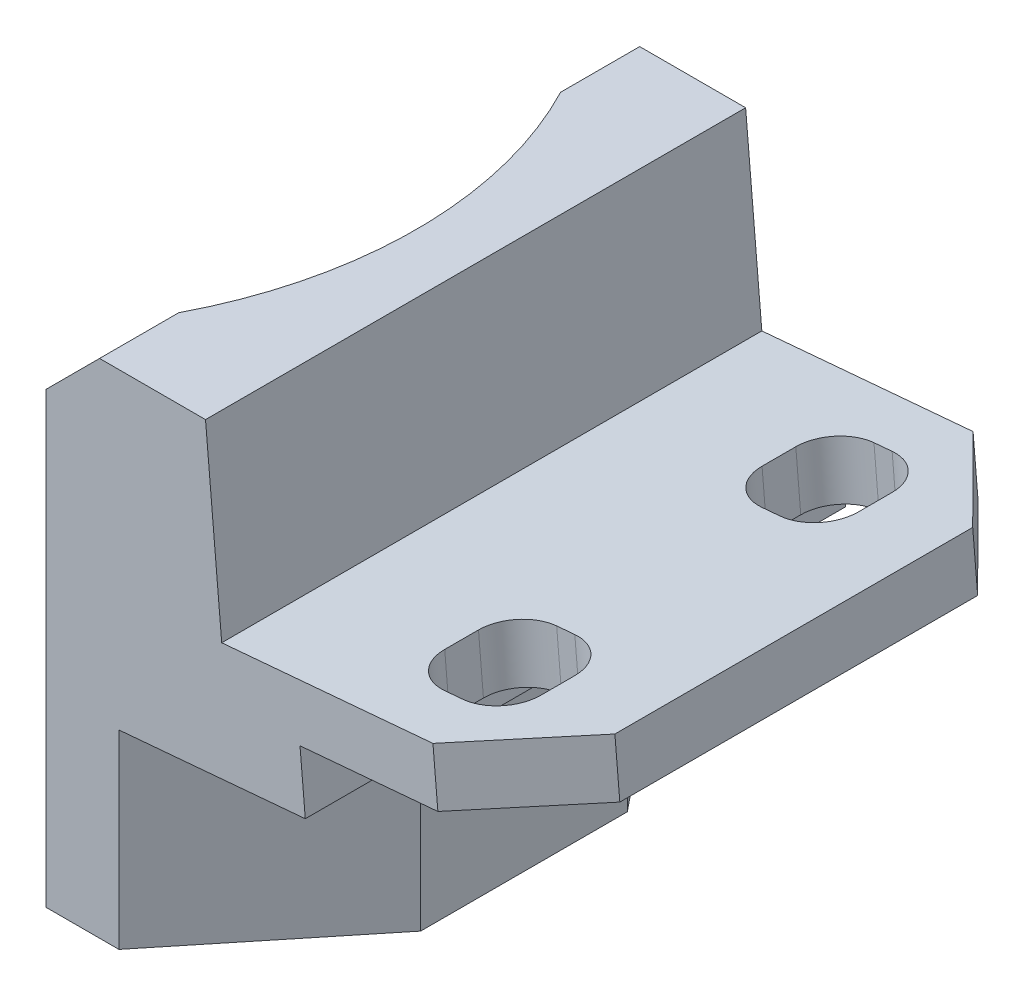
ISO-10303-21;
HEADER;
FILE_DESCRIPTION(('STEP AP214'),'2;1');
FILE_NAME('part.step','',(''),(''),'','','');
FILE_SCHEMA(('AUTOMOTIVE_DESIGN { 1 0 10303 214 1 1 1 1 }'));
ENDSEC;
DATA;
#1=APPLICATION_CONTEXT('core data for automotive mechanical design processes');
#2=APPLICATION_PROTOCOL_DEFINITION('international standard','automotive_design',2000,#1);
#3=PRODUCT_CONTEXT('',#1,'mechanical');
#4=PRODUCT('Part','Part','',(#3));
#5=PRODUCT_RELATED_PRODUCT_CATEGORY('part','',(#4));
#6=PRODUCT_DEFINITION_FORMATION('','',#4);
#7=PRODUCT_DEFINITION_CONTEXT('part definition',#1,'design');
#8=PRODUCT_DEFINITION('design','',#6,#7);
#9=PRODUCT_DEFINITION_SHAPE('','',#8);
#10=(LENGTH_UNIT() NAMED_UNIT(*) SI_UNIT(.MILLI.,.METRE.));
#11=(NAMED_UNIT(*) PLANE_ANGLE_UNIT() SI_UNIT($,.RADIAN.));
#12=(NAMED_UNIT(*) SI_UNIT($,.STERADIAN.) SOLID_ANGLE_UNIT());
#13=UNCERTAINTY_MEASURE_WITH_UNIT(LENGTH_MEASURE(1.E-05),#10,'distance_accuracy_value','');
#14=(GEOMETRIC_REPRESENTATION_CONTEXT(3) GLOBAL_UNCERTAINTY_ASSIGNED_CONTEXT((#13)) GLOBAL_UNIT_ASSIGNED_CONTEXT((#10,
#11,#12)) REPRESENTATION_CONTEXT('',''));
#15=CARTESIAN_POINT('',(0.,0.,0.));
#16=DIRECTION('',(0.,0.,1.));
#17=DIRECTION('',(1.,0.,0.));
#18=AXIS2_PLACEMENT_3D('',#15,#16,#17);
#19=CARTESIAN_POINT('',(30.279335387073,-5.97249765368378,10.16));
#20=DIRECTION('',(-0.996194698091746,-0.0871557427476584,0.));
#21=DIRECTION('',(0.0871557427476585,-0.996194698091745,0.));
#22=AXIS2_PLACEMENT_3D('',#19,#20,#21);
#23=PLANE('',#22);
#24=DIRECTION('',(0.,0.,1.));
#25=VECTOR('',#24,1.);
#26=CARTESIAN_POINT('',(30.4652908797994,-8.09797866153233,10.16));
#27=LINE('',#26,#25);
#28=CARTESIAN_POINT('',(30.4652908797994,-8.09797866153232,-6.73099999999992));
#29=VERTEX_POINT('',#28);
#30=CARTESIAN_POINT('',(30.4652908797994,-8.09797866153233,6.73099999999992));
#31=VERTEX_POINT('',#30);
#32=EDGE_CURVE('E468',#29,#31,#27,.T.);
#33=ORIENTED_EDGE('',*,*,#32,.F.);
#34=DIRECTION('',(-0.0871557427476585,0.996194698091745,0.));
#35=VECTOR('',#34,1.);
#36=CARTESIAN_POINT('',(30.2793353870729,-5.97249765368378,-6.731));
#37=LINE('',#36,#35);
#38=CARTESIAN_POINT('',(30.2793353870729,-5.97249765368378,-6.73099999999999));
#39=VERTEX_POINT('',#38);
#40=EDGE_CURVE('E312',#29,#39,#37,.T.);
#41=ORIENTED_EDGE('',*,*,#40,.T.);
#42=DIRECTION('',(0.,0.,-1.));
#43=VECTOR('',#42,1.);
#44=CARTESIAN_POINT('',(30.279335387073,-5.97249765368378,10.16));
#45=LINE('',#44,#43);
#46=CARTESIAN_POINT('',(30.279335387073,-5.97249765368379,6.73099999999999));
#47=VERTEX_POINT('',#46);
#48=EDGE_CURVE('E283',#47,#39,#45,.T.);
#49=ORIENTED_EDGE('',*,*,#48,.F.);
#50=DIRECTION('',(0.0871557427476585,-0.996194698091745,0.));
#51=VECTOR('',#50,1.);
#52=CARTESIAN_POINT('',(30.6645289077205,-10.3752797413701,6.73099999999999));
#53=LINE('',#52,#51);
#54=EDGE_CURVE('E314',#47,#31,#53,.T.);
#55=ORIENTED_EDGE('',*,*,#54,.T.);
#56=EDGE_LOOP('',(#33,#41,#49,#55));
#57=FACE_BOUND('',#56,.T.);
#58=ADVANCED_FACE('F32',(#57),#23,.F.);
#59=CARTESIAN_POINT('',(26.2677276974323,0.537025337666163,10.16));
#60=DIRECTION('',(0.70441602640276,0.0616284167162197,0.707106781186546));
#61=DIRECTION('',(0.708453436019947,0.,-0.705757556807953));
#62=AXIS2_PLACEMENT_3D('',#59,#60,#61);
#63=PLANE('',#62);
#64=DIRECTION('',(-0.0871557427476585,0.996194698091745,0.));
#65=VECTOR('',#64,1.);
#66=CARTESIAN_POINT('',(26.8633837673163,-6.2713546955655,10.16));
#67=LINE('',#66,#65);
#68=CARTESIAN_POINT('',(27.0493392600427,-8.39683570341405,10.16));
#69=VERTEX_POINT('',#68);
#70=CARTESIAN_POINT('',(26.8633837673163,-6.2713546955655,10.16));
#71=VERTEX_POINT('',#70);
#72=EDGE_CURVE('E306',#69,#71,#67,.T.);
#73=ORIENTED_EDGE('',*,*,#72,.F.);
#74=DIRECTION('',(0.704416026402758,0.0616284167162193,-0.707106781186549));
#75=VECTOR('',#74,1.);
#76=CARTESIAN_POINT('',(27.0493392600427,-8.39683570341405,10.16));
#77=LINE('',#76,#75);
#78=EDGE_CURVE('E407',#69,#31,#77,.T.);
#79=ORIENTED_EDGE('',*,*,#78,.T.);
#80=ORIENTED_EDGE('',*,*,#54,.F.);
#81=DIRECTION('',(0.704416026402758,0.0616284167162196,-0.707106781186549));
#82=VECTOR('',#81,1.);
#83=CARTESIAN_POINT('',(26.8633837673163,-6.2713546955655,10.16));
#84=LINE('',#83,#82);
#85=EDGE_CURVE('E310',#71,#47,#84,.T.);
#86=ORIENTED_EDGE('',*,*,#85,.F.);
#87=EDGE_LOOP('',(#73,#79,#80,#86));
#88=FACE_BOUND('',#87,.T.);
#89=ADVANCED_FACE('F516',(#88),#63,.T.);
#90=CARTESIAN_POINT('',(30.2793353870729,-5.97249765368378,-6.731));
#91=DIRECTION('',(-0.704416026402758,-0.0616284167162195,0.707106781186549));
#92=DIRECTION('',(0.70845343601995,0.,0.705757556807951));
#93=AXIS2_PLACEMENT_3D('',#90,#91,#92);
#94=PLANE('',#93);
#95=ORIENTED_EDGE('',*,*,#40,.F.);
#96=DIRECTION('',(0.70441602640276,0.0616284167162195,0.707106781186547));
#97=VECTOR('',#96,1.);
#98=CARTESIAN_POINT('',(30.4652908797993,-8.09797866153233,-6.731));
#99=LINE('',#98,#97);
#100=CARTESIAN_POINT('',(27.0493392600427,-8.39683570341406,-10.16));
#101=VERTEX_POINT('',#100);
#102=EDGE_CURVE('E510',#29,#101,#99,.F.);
#103=ORIENTED_EDGE('',*,*,#102,.T.);
#104=DIRECTION('',(0.0871557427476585,-0.996194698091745,0.));
#105=VECTOR('',#104,1.);
#106=CARTESIAN_POINT('',(26.2677276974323,0.537025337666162,-10.16));
#107=LINE('',#106,#105);
#108=CARTESIAN_POINT('',(26.8633837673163,-6.2713546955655,-10.16));
#109=VERTEX_POINT('',#108);
#110=EDGE_CURVE('E317',#109,#101,#107,.T.);
#111=ORIENTED_EDGE('',*,*,#110,.F.);
#112=DIRECTION('',(0.70441602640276,0.0616284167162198,0.707106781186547));
#113=VECTOR('',#112,1.);
#114=CARTESIAN_POINT('',(30.2793353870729,-5.97249765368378,-6.731));
#115=LINE('',#114,#113);
#116=EDGE_CURVE('E308',#39,#109,#115,.F.);
#117=ORIENTED_EDGE('',*,*,#116,.F.);
#118=EDGE_LOOP('',(#95,#103,#111,#117));
#119=FACE_BOUND('',#118,.T.);
#120=ADVANCED_FACE('F34',(#119),#94,.F.);
#121=CARTESIAN_POINT('',(25.2427902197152,1.17768629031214,6.604));
#122=DIRECTION('',(0.0871557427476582,-0.996194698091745,0.));
#123=DIRECTION('',(0.996194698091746,0.0871557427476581,0.));
#124=AXIS2_PLACEMENT_3D('',#121,#122,#123);
#125=CYLINDRICAL_SURFACE('',#124,1.4732);
#126=CARTESIAN_POINT('',(26.0878121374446,-8.4809584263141,6.604));
#127=DIRECTION('',(0.0871557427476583,-0.996194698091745,0.));
#128=DIRECTION('',(0.996194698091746,0.0871557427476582,0.));
#129=AXIS2_PLACEMENT_3D('',#126,#127,#128);
#130=CIRCLE('',#129,1.4732);
#131=CARTESIAN_POINT('',(26.0878121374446,-8.4809584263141,8.0772));
#132=VERTEX_POINT('',#131);
#133=CARTESIAN_POINT('',(27.5554061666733,-8.35256058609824,6.60399999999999));
#134=VERTEX_POINT('',#133);
#135=EDGE_CURVE('E506',#132,#134,#130,.F.);
#136=ORIENTED_EDGE('',*,*,#135,.F.);
#137=DIRECTION('',(0.0871557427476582,-0.996194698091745,0.));
#138=VECTOR('',#137,1.);
#139=CARTESIAN_POINT('',(25.2427902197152,1.17768629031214,8.0772));
#140=LINE('',#139,#138);
#141=CARTESIAN_POINT('',(25.9018566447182,-6.35547741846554,8.0772));
#142=VERTEX_POINT('',#141);
#143=EDGE_CURVE('E409',#142,#132,#140,.T.);
#144=ORIENTED_EDGE('',*,*,#143,.F.);
#145=CARTESIAN_POINT('',(25.9018566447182,-6.35547741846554,6.604));
#146=DIRECTION('',(0.0871557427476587,-0.996194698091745,0.));
#147=DIRECTION('',(0.996194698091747,0.0871557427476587,0.));
#148=AXIS2_PLACEMENT_3D('',#145,#146,#147);
#149=CIRCLE('',#148,1.4732);
#150=CARTESIAN_POINT('',(27.3694506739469,-6.22707957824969,6.60399999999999));
#151=VERTEX_POINT('',#150);
#152=EDGE_CURVE('E329',#151,#142,#149,.T.);
#153=ORIENTED_EDGE('',*,*,#152,.F.);
#154=DIRECTION('',(0.0871557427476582,-0.996194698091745,0.));
#155=VECTOR('',#154,1.);
#156=CARTESIAN_POINT('',(26.710384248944,1.30608413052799,6.60399999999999));
#157=LINE('',#156,#155);
#158=EDGE_CURVE('E410',#151,#134,#157,.T.);
#159=ORIENTED_EDGE('',*,*,#158,.T.);
#160=EDGE_LOOP('',(#136,#144,#153,#159));
#161=FACE_BOUND('',#160,.T.);
#162=ADVANCED_FACE('F566',(#161),#125,.F.);
#163=CARTESIAN_POINT('',(26.710384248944,1.30608413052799,6.60399999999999));
#164=DIRECTION('',(0.996194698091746,0.0871557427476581,0.));
#165=DIRECTION('',(-0.0871557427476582,0.996194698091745,0.));
#166=AXIS2_PLACEMENT_3D('',#163,#164,#165);
#167=PLANE('',#166);
#168=DIRECTION('',(0.,0.,-1.));
#169=VECTOR('',#168,1.);
#170=CARTESIAN_POINT('',(27.5554061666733,-8.35256058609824,6.60399999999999));
#171=LINE('',#170,#169);
#172=CARTESIAN_POINT('',(27.5554061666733,-8.35256058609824,5.33400000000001));
#173=VERTEX_POINT('',#172);
#174=EDGE_CURVE('E504',#134,#173,#171,.T.);
#175=ORIENTED_EDGE('',*,*,#174,.F.);
#176=ORIENTED_EDGE('',*,*,#158,.F.);
#177=DIRECTION('',(0.,0.,1.));
#178=VECTOR('',#177,1.);
#179=CARTESIAN_POINT('',(27.3694506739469,-6.22707957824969,10.16));
#180=LINE('',#179,#178);
#181=CARTESIAN_POINT('',(27.3694506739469,-6.2270795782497,5.33400000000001));
#182=VERTEX_POINT('',#181);
#183=EDGE_CURVE('E341',#182,#151,#180,.T.);
#184=ORIENTED_EDGE('',*,*,#183,.F.);
#185=DIRECTION('',(0.0871557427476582,-0.996194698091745,0.));
#186=VECTOR('',#185,1.);
#187=CARTESIAN_POINT('',(26.710384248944,1.30608413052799,5.33400000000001));
#188=LINE('',#187,#186);
#189=EDGE_CURVE('E414',#182,#173,#188,.T.);
#190=ORIENTED_EDGE('',*,*,#189,.T.);
#191=EDGE_LOOP('',(#175,#176,#184,#190));
#192=FACE_BOUND('',#191,.T.);
#193=ADVANCED_FACE('F571',(#192),#167,.F.);
#194=CARTESIAN_POINT('',(25.2427902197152,1.17768629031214,5.334));
#195=DIRECTION('',(0.0871557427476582,-0.996194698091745,0.));
#196=DIRECTION('',(0.996194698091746,0.0871557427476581,0.));
#197=AXIS2_PLACEMENT_3D('',#194,#195,#196);
#198=CYLINDRICAL_SURFACE('',#197,1.4732);
#199=CARTESIAN_POINT('',(26.0878121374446,-8.4809584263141,5.334));
#200=DIRECTION('',(0.0871557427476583,-0.996194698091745,0.));
#201=DIRECTION('',(0.996194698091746,0.0871557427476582,0.));
#202=AXIS2_PLACEMENT_3D('',#199,#200,#201);
#203=CIRCLE('',#202,1.4732);
#204=CARTESIAN_POINT('',(26.0878121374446,-8.4809584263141,3.8608));
#205=VERTEX_POINT('',#204);
#206=EDGE_CURVE('E502',#173,#205,#203,.F.);
#207=ORIENTED_EDGE('',*,*,#206,.F.);
#208=ORIENTED_EDGE('',*,*,#189,.F.);
#209=CARTESIAN_POINT('',(25.9018566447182,-6.35547741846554,5.334));
#210=DIRECTION('',(0.0871557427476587,-0.996194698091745,0.));
#211=DIRECTION('',(0.996194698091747,0.0871557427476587,0.));
#212=AXIS2_PLACEMENT_3D('',#209,#210,#211);
#213=CIRCLE('',#212,1.4732);
#214=CARTESIAN_POINT('',(25.9018566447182,-6.35547741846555,3.8608));
#215=VERTEX_POINT('',#214);
#216=EDGE_CURVE('E338',#215,#182,#213,.T.);
#217=ORIENTED_EDGE('',*,*,#216,.F.);
#218=DIRECTION('',(0.0871557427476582,-0.996194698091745,0.));
#219=VECTOR('',#218,1.);
#220=CARTESIAN_POINT('',(25.2427902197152,1.17768629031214,3.8608));
#221=LINE('',#220,#219);
#222=EDGE_CURVE('E417',#215,#205,#221,.T.);
#223=ORIENTED_EDGE('',*,*,#222,.T.);
#224=EDGE_LOOP('',(#207,#208,#217,#223));
#225=FACE_BOUND('',#224,.T.);
#226=ADVANCED_FACE('F672',(#225),#198,.F.);
#227=CARTESIAN_POINT('',(25.2427902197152,1.17768629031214,3.86080000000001));
#228=DIRECTION('',(0.,0.,-1.));
#229=DIRECTION('',(-1.,0.,0.));
#230=AXIS2_PLACEMENT_3D('',#227,#228,#229);
#231=PLANE('',#230);
#232=DIRECTION('',(-0.996194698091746,-0.0871557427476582,0.));
#233=VECTOR('',#232,1.);
#234=CARTESIAN_POINT('',(26.0878121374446,-8.4809584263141,3.8608));
#235=LINE('',#234,#233);
#236=CARTESIAN_POINT('',(25.4046218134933,-8.54072983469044,3.8608));
#237=VERTEX_POINT('',#236);
#238=EDGE_CURVE('E500',#205,#237,#235,.T.);
#239=ORIENTED_EDGE('',*,*,#238,.F.);
#240=ORIENTED_EDGE('',*,*,#222,.F.);
#241=DIRECTION('',(0.996194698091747,0.0871557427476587,0.));
#242=VECTOR('',#241,1.);
#243=CARTESIAN_POINT('',(20.1579972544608,-6.858,3.8608));
#244=LINE('',#243,#242);
#245=CARTESIAN_POINT('',(25.2186663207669,-6.41524882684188,3.8608));
#246=VERTEX_POINT('',#245);
#247=EDGE_CURVE('E335',#246,#215,#244,.T.);
#248=ORIENTED_EDGE('',*,*,#247,.F.);
#249=DIRECTION('',(0.0871557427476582,-0.996194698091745,0.));
#250=VECTOR('',#249,1.);
#251=CARTESIAN_POINT('',(24.5595998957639,1.1179148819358,3.8608));
#252=LINE('',#251,#250);
#253=EDGE_CURVE('E420',#246,#237,#252,.T.);
#254=ORIENTED_EDGE('',*,*,#253,.T.);
#255=EDGE_LOOP('',(#239,#240,#248,#254));
#256=FACE_BOUND('',#255,.T.);
#257=ADVANCED_FACE('F681',(#256),#231,.F.);
#258=CARTESIAN_POINT('',(24.5595998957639,1.1179148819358,5.334));
#259=DIRECTION('',(0.0871557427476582,-0.996194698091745,0.));
#260=DIRECTION('',(0.996194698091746,0.0871557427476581,0.));
#261=AXIS2_PLACEMENT_3D('',#258,#259,#260);
#262=CYLINDRICAL_SURFACE('',#261,1.4732);
#263=CARTESIAN_POINT('',(25.4046218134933,-8.54072983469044,5.334));
#264=DIRECTION('',(0.0871557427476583,-0.996194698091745,0.));
#265=DIRECTION('',(0.996194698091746,0.0871557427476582,0.));
#266=AXIS2_PLACEMENT_3D('',#263,#264,#265);
#267=CIRCLE('',#266,1.4732);
#268=CARTESIAN_POINT('',(23.9370277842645,-8.66912767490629,5.334));
#269=VERTEX_POINT('',#268);
#270=EDGE_CURVE('E498',#237,#269,#267,.F.);
#271=ORIENTED_EDGE('',*,*,#270,.F.);
#272=ORIENTED_EDGE('',*,*,#253,.F.);
#273=CARTESIAN_POINT('',(25.2186663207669,-6.41524882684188,5.334));
#274=DIRECTION('',(0.0871557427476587,-0.996194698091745,0.));
#275=DIRECTION('',(0.996194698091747,0.0871557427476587,0.));
#276=AXIS2_PLACEMENT_3D('',#273,#274,#275);
#277=CIRCLE('',#276,1.4732);
#278=CARTESIAN_POINT('',(23.7510722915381,-6.54364666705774,5.334));
#279=VERTEX_POINT('',#278);
#280=EDGE_CURVE('E332',#279,#246,#277,.T.);
#281=ORIENTED_EDGE('',*,*,#280,.F.);
#282=DIRECTION('',(0.0871557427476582,-0.996194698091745,0.));
#283=VECTOR('',#282,1.);
#284=CARTESIAN_POINT('',(23.0920058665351,0.989517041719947,5.334));
#285=LINE('',#284,#283);
#286=EDGE_CURVE('E423',#279,#269,#285,.T.);
#287=ORIENTED_EDGE('',*,*,#286,.T.);
#288=EDGE_LOOP('',(#271,#272,#281,#287));
#289=FACE_BOUND('',#288,.T.);
#290=ADVANCED_FACE('F690',(#289),#262,.F.);
#291=CARTESIAN_POINT('',(24.5595998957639,1.1179148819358,6.604));
#292=DIRECTION('',(0.0871557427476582,-0.996194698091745,0.));
#293=DIRECTION('',(0.996194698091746,0.0871557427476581,0.));
#294=AXIS2_PLACEMENT_3D('',#291,#292,#293);
#295=CYLINDRICAL_SURFACE('',#294,1.4732);
#296=CARTESIAN_POINT('',(25.4046218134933,-8.54072983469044,6.604));
#297=DIRECTION('',(0.0871557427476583,-0.996194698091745,0.));
#298=DIRECTION('',(0.996194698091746,0.0871557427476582,0.));
#299=AXIS2_PLACEMENT_3D('',#296,#297,#298);
#300=CIRCLE('',#299,1.4732);
#301=CARTESIAN_POINT('',(23.9370277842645,-8.66912767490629,6.604));
#302=VERTEX_POINT('',#301);
#303=CARTESIAN_POINT('',(25.4046218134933,-8.54072983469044,8.0772));
#304=VERTEX_POINT('',#303);
#305=EDGE_CURVE('E496',#302,#304,#300,.F.);
#306=ORIENTED_EDGE('',*,*,#305,.F.);
#307=DIRECTION('',(0.0871557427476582,-0.996194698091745,0.));
#308=VECTOR('',#307,1.);
#309=CARTESIAN_POINT('',(23.0920058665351,0.989517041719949,6.604));
#310=LINE('',#309,#308);
#311=CARTESIAN_POINT('',(23.7510722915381,-6.54364666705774,6.604));
#312=VERTEX_POINT('',#311);
#313=EDGE_CURVE('E426',#312,#302,#310,.T.);
#314=ORIENTED_EDGE('',*,*,#313,.F.);
#315=CARTESIAN_POINT('',(25.2186663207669,-6.41524882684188,6.604));
#316=DIRECTION('',(0.0871557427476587,-0.996194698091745,0.));
#317=DIRECTION('',(0.996194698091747,0.0871557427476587,0.));
#318=AXIS2_PLACEMENT_3D('',#315,#316,#317);
#319=CIRCLE('',#318,1.4732);
#320=CARTESIAN_POINT('',(25.2186663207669,-6.41524882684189,8.0772));
#321=VERTEX_POINT('',#320);
#322=EDGE_CURVE('E326',#321,#312,#319,.T.);
#323=ORIENTED_EDGE('',*,*,#322,.F.);
#324=DIRECTION('',(0.0871557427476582,-0.996194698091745,0.));
#325=VECTOR('',#324,1.);
#326=CARTESIAN_POINT('',(24.5595998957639,1.1179148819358,8.0772));
#327=LINE('',#326,#325);
#328=EDGE_CURVE('E429',#321,#304,#327,.T.);
#329=ORIENTED_EDGE('',*,*,#328,.T.);
#330=EDGE_LOOP('',(#306,#314,#323,#329));
#331=FACE_BOUND('',#330,.T.);
#332=ADVANCED_FACE('F699',(#331),#295,.F.);
#333=CARTESIAN_POINT('',(25.2427902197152,1.17768629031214,8.0772));
#334=DIRECTION('',(0.,0.,1.));
#335=DIRECTION('',(1.,0.,0.));
#336=AXIS2_PLACEMENT_3D('',#333,#334,#335);
#337=PLANE('',#336);
#338=DIRECTION('',(0.996194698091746,0.0871557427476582,0.));
#339=VECTOR('',#338,1.);
#340=CARTESIAN_POINT('',(26.0878121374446,-8.4809584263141,8.0772));
#341=LINE('',#340,#339);
#342=EDGE_CURVE('E508',#304,#132,#341,.T.);
#343=ORIENTED_EDGE('',*,*,#342,.F.);
#344=ORIENTED_EDGE('',*,*,#328,.F.);
#345=DIRECTION('',(-0.996194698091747,-0.0871557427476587,0.));
#346=VECTOR('',#345,1.);
#347=CARTESIAN_POINT('',(20.1579972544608,-6.858,8.0772));
#348=LINE('',#347,#346);
#349=EDGE_CURVE('E323',#142,#321,#348,.T.);
#350=ORIENTED_EDGE('',*,*,#349,.F.);
#351=ORIENTED_EDGE('',*,*,#143,.T.);
#352=EDGE_LOOP('',(#343,#344,#350,#351));
#353=FACE_BOUND('',#352,.T.);
#354=ADVANCED_FACE('F708',(#353),#337,.F.);
#355=CARTESIAN_POINT('',(23.0920058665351,0.989517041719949,6.604));
#356=DIRECTION('',(-0.996194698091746,-0.0871557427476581,0.));
#357=DIRECTION('',(0.0871557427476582,-0.996194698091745,0.));
#358=AXIS2_PLACEMENT_3D('',#355,#356,#357);
#359=PLANE('',#358);
#360=DIRECTION('',(0.,0.,1.));
#361=VECTOR('',#360,1.);
#362=CARTESIAN_POINT('',(23.9370277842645,-8.66912767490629,6.604));
#363=LINE('',#362,#361);
#364=EDGE_CURVE('E494',#269,#302,#363,.T.);
#365=ORIENTED_EDGE('',*,*,#364,.F.);
#366=ORIENTED_EDGE('',*,*,#286,.F.);
#367=DIRECTION('',(0.,0.,-1.));
#368=VECTOR('',#367,1.);
#369=CARTESIAN_POINT('',(23.7510722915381,-6.54364666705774,10.16));
#370=LINE('',#369,#368);
#371=EDGE_CURVE('E413',#312,#279,#370,.T.);
#372=ORIENTED_EDGE('',*,*,#371,.F.);
#373=ORIENTED_EDGE('',*,*,#313,.T.);
#374=EDGE_LOOP('',(#365,#366,#372,#373));
#375=FACE_BOUND('',#374,.T.);
#376=ADVANCED_FACE('F717',(#375),#359,.F.);
#377=CARTESIAN_POINT('',(25.2427902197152,1.17768629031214,-6.604));
#378=DIRECTION('',(0.0871557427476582,-0.996194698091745,0.));
#379=DIRECTION('',(0.996194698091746,0.0871557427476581,0.));
#380=AXIS2_PLACEMENT_3D('',#377,#378,#379);
#381=CYLINDRICAL_SURFACE('',#380,1.4732);
#382=DIRECTION('',(0.0871557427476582,-0.996194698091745,0.));
#383=VECTOR('',#382,1.);
#384=CARTESIAN_POINT('',(25.2427902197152,1.17768629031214,-8.0772));
#385=LINE('',#384,#383);
#386=CARTESIAN_POINT('',(25.9018566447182,-6.35547741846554,-8.0772));
#387=VERTEX_POINT('',#386);
#388=CARTESIAN_POINT('',(26.0878121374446,-8.4809584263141,-8.0772));
#389=VERTEX_POINT('',#388);
#390=EDGE_CURVE('E363',#387,#389,#385,.T.);
#391=ORIENTED_EDGE('',*,*,#390,.T.);
#392=CARTESIAN_POINT('',(26.0878121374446,-8.4809584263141,-6.604));
#393=DIRECTION('',(0.0871557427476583,-0.996194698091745,0.));
#394=DIRECTION('',(0.996194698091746,0.0871557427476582,0.));
#395=AXIS2_PLACEMENT_3D('',#392,#393,#394);
#396=CIRCLE('',#395,1.4732);
#397=CARTESIAN_POINT('',(27.5554061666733,-8.35256058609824,-6.60399999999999));
#398=VERTEX_POINT('',#397);
#399=EDGE_CURVE('E483',#389,#398,#396,.T.);
#400=ORIENTED_EDGE('',*,*,#399,.T.);
#401=DIRECTION('',(0.0871557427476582,-0.996194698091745,0.));
#402=VECTOR('',#401,1.);
#403=CARTESIAN_POINT('',(26.710384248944,1.30608413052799,-6.60399999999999));
#404=LINE('',#403,#402);
#405=CARTESIAN_POINT('',(27.3694506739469,-6.22707957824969,-6.60399999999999));
#406=VERTEX_POINT('',#405);
#407=EDGE_CURVE('E365',#406,#398,#404,.T.);
#408=ORIENTED_EDGE('',*,*,#407,.F.);
#409=CARTESIAN_POINT('',(25.9018566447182,-6.35547741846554,-6.604));
#410=DIRECTION('',(0.0871557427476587,-0.996194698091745,0.));
#411=DIRECTION('',(0.996194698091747,0.0871557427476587,0.));
#412=AXIS2_PLACEMENT_3D('',#409,#410,#411);
#413=CIRCLE('',#412,1.4732);
#414=EDGE_CURVE('E40',#406,#387,#413,.F.);
#415=ORIENTED_EDGE('',*,*,#414,.T.);
#416=EDGE_LOOP('',(#391,#400,#408,#415));
#417=FACE_BOUND('',#416,.T.);
#418=ADVANCED_FACE('F361',(#417),#381,.F.);
#419=CARTESIAN_POINT('',(25.2427902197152,1.17768629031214,-8.0772));
#420=DIRECTION('',(0.,0.,1.));
#421=DIRECTION('',(1.,0.,0.));
#422=AXIS2_PLACEMENT_3D('',#419,#420,#421);
#423=PLANE('',#422);
#424=DIRECTION('',(0.0871557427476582,-0.996194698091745,0.));
#425=VECTOR('',#424,1.);
#426=CARTESIAN_POINT('',(24.5595998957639,1.1179148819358,-8.0772));
#427=LINE('',#426,#425);
#428=CARTESIAN_POINT('',(25.2186663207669,-6.41524882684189,-8.0772));
#429=VERTEX_POINT('',#428);
#430=CARTESIAN_POINT('',(25.4046218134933,-8.54072983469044,-8.0772));
#431=VERTEX_POINT('',#430);
#432=EDGE_CURVE('E376',#429,#431,#427,.T.);
#433=ORIENTED_EDGE('',*,*,#432,.T.);
#434=DIRECTION('',(0.996194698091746,0.0871557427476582,0.));
#435=VECTOR('',#434,1.);
#436=CARTESIAN_POINT('',(26.0878121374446,-8.4809584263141,-8.0772));
#437=LINE('',#436,#435);
#438=EDGE_CURVE('E374',#431,#389,#437,.T.);
#439=ORIENTED_EDGE('',*,*,#438,.T.);
#440=ORIENTED_EDGE('',*,*,#390,.F.);
#441=DIRECTION('',(-0.996194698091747,-0.0871557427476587,0.));
#442=VECTOR('',#441,1.);
#443=CARTESIAN_POINT('',(20.1579972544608,-6.858,-8.0772));
#444=LINE('',#443,#442);
#445=EDGE_CURVE('E355',#387,#429,#444,.T.);
#446=ORIENTED_EDGE('',*,*,#445,.T.);
#447=EDGE_LOOP('',(#433,#439,#440,#446));
#448=FACE_BOUND('',#447,.T.);
#449=ADVANCED_FACE('F372',(#448),#423,.T.);
#450=CARTESIAN_POINT('',(24.5595998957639,1.1179148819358,-6.604));
#451=DIRECTION('',(0.0871557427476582,-0.996194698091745,0.));
#452=DIRECTION('',(0.996194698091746,0.0871557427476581,0.));
#453=AXIS2_PLACEMENT_3D('',#450,#451,#452);
#454=CYLINDRICAL_SURFACE('',#453,1.4732);
#455=DIRECTION('',(0.0871557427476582,-0.996194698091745,0.));
#456=VECTOR('',#455,1.);
#457=CARTESIAN_POINT('',(23.0920058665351,0.989517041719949,-6.604));
#458=LINE('',#457,#456);
#459=CARTESIAN_POINT('',(23.7510722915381,-6.54364666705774,-6.604));
#460=VERTEX_POINT('',#459);
#461=CARTESIAN_POINT('',(23.9370277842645,-8.66912767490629,-6.604));
#462=VERTEX_POINT('',#461);
#463=EDGE_CURVE('E387',#460,#462,#458,.T.);
#464=ORIENTED_EDGE('',*,*,#463,.T.);
#465=CARTESIAN_POINT('',(25.4046218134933,-8.54072983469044,-6.604));
#466=DIRECTION('',(0.0871557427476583,-0.996194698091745,0.));
#467=DIRECTION('',(0.996194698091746,0.0871557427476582,0.));
#468=AXIS2_PLACEMENT_3D('',#465,#466,#467);
#469=CIRCLE('',#468,1.4732);
#470=EDGE_CURVE('E480',#462,#431,#469,.T.);
#471=ORIENTED_EDGE('',*,*,#470,.T.);
#472=ORIENTED_EDGE('',*,*,#432,.F.);
#473=CARTESIAN_POINT('',(25.2186663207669,-6.41524882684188,-6.604));
#474=DIRECTION('',(0.0871557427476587,-0.996194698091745,0.));
#475=DIRECTION('',(0.996194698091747,0.0871557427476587,0.));
#476=AXIS2_PLACEMENT_3D('',#473,#474,#475);
#477=CIRCLE('',#476,1.4732);
#478=EDGE_CURVE('E353',#429,#460,#477,.F.);
#479=ORIENTED_EDGE('',*,*,#478,.T.);
#480=EDGE_LOOP('',(#464,#471,#472,#479));
#481=FACE_BOUND('',#480,.T.);
#482=ADVANCED_FACE('F385',(#481),#454,.F.);
#483=CARTESIAN_POINT('',(24.5595998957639,1.1179148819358,-5.334));
#484=DIRECTION('',(0.0871557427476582,-0.996194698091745,0.));
#485=DIRECTION('',(0.996194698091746,0.0871557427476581,0.));
#486=AXIS2_PLACEMENT_3D('',#483,#484,#485);
#487=CYLINDRICAL_SURFACE('',#486,1.4732);
#488=DIRECTION('',(0.0871557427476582,-0.996194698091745,0.));
#489=VECTOR('',#488,1.);
#490=CARTESIAN_POINT('',(24.5595998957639,1.1179148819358,-3.8608));
#491=LINE('',#490,#489);
#492=CARTESIAN_POINT('',(25.2186663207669,-6.41524882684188,-3.8608));
#493=VERTEX_POINT('',#492);
#494=CARTESIAN_POINT('',(25.4046218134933,-8.54072983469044,-3.8608));
#495=VERTEX_POINT('',#494);
#496=EDGE_CURVE('E395',#493,#495,#491,.T.);
#497=ORIENTED_EDGE('',*,*,#496,.T.);
#498=CARTESIAN_POINT('',(25.4046218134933,-8.54072983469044,-5.334));
#499=DIRECTION('',(0.0871557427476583,-0.996194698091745,0.));
#500=DIRECTION('',(0.996194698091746,0.0871557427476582,0.));
#501=AXIS2_PLACEMENT_3D('',#498,#499,#500);
#502=CIRCLE('',#501,1.4732);
#503=CARTESIAN_POINT('',(23.9370277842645,-8.66912767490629,-5.334));
#504=VERTEX_POINT('',#503);
#505=EDGE_CURVE('E475',#495,#504,#502,.T.);
#506=ORIENTED_EDGE('',*,*,#505,.T.);
#507=DIRECTION('',(0.0871557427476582,-0.996194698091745,0.));
#508=VECTOR('',#507,1.);
#509=CARTESIAN_POINT('',(23.0920058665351,0.989517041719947,-5.334));
#510=LINE('',#509,#508);
#511=CARTESIAN_POINT('',(23.7510722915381,-6.54364666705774,-5.334));
#512=VERTEX_POINT('',#511);
#513=EDGE_CURVE('E392',#512,#504,#510,.T.);
#514=ORIENTED_EDGE('',*,*,#513,.F.);
#515=CARTESIAN_POINT('',(25.2186663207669,-6.41524882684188,-5.334));
#516=DIRECTION('',(0.0871557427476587,-0.996194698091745,0.));
#517=DIRECTION('',(0.996194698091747,0.0871557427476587,0.));
#518=AXIS2_PLACEMENT_3D('',#515,#516,#517);
#519=CIRCLE('',#518,1.4732);
#520=EDGE_CURVE('E351',#512,#493,#519,.F.);
#521=ORIENTED_EDGE('',*,*,#520,.T.);
#522=EDGE_LOOP('',(#497,#506,#514,#521));
#523=FACE_BOUND('',#522,.T.);
#524=ADVANCED_FACE('F748',(#523),#487,.F.);
#525=CARTESIAN_POINT('',(25.2427902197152,1.17768629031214,-3.8608));
#526=DIRECTION('',(0.,0.,-1.));
#527=DIRECTION('',(-1.,0.,0.));
#528=AXIS2_PLACEMENT_3D('',#525,#526,#527);
#529=PLANE('',#528);
#530=DIRECTION('',(0.0871557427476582,-0.996194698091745,0.));
#531=VECTOR('',#530,1.);
#532=CARTESIAN_POINT('',(25.2427902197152,1.17768629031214,-3.8608));
#533=LINE('',#532,#531);
#534=CARTESIAN_POINT('',(25.9018566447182,-6.35547741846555,-3.8608));
#535=VERTEX_POINT('',#534);
#536=CARTESIAN_POINT('',(26.0878121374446,-8.4809584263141,-3.8608));
#537=VERTEX_POINT('',#536);
#538=EDGE_CURVE('E400',#535,#537,#533,.T.);
#539=ORIENTED_EDGE('',*,*,#538,.T.);
#540=DIRECTION('',(-0.996194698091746,-0.0871557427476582,0.));
#541=VECTOR('',#540,1.);
#542=CARTESIAN_POINT('',(26.0878121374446,-8.4809584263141,-3.8608));
#543=LINE('',#542,#541);
#544=EDGE_CURVE('E491',#537,#495,#543,.T.);
#545=ORIENTED_EDGE('',*,*,#544,.T.);
#546=ORIENTED_EDGE('',*,*,#496,.F.);
#547=DIRECTION('',(0.996194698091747,0.0871557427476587,0.));
#548=VECTOR('',#547,1.);
#549=CARTESIAN_POINT('',(20.1579972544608,-6.858,-3.8608));
#550=LINE('',#549,#548);
#551=EDGE_CURVE('E349',#493,#535,#550,.T.);
#552=ORIENTED_EDGE('',*,*,#551,.T.);
#553=EDGE_LOOP('',(#539,#545,#546,#552));
#554=FACE_BOUND('',#553,.T.);
#555=ADVANCED_FACE('F756',(#554),#529,.T.);
#556=CARTESIAN_POINT('',(25.2427902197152,1.17768629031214,-5.334));
#557=DIRECTION('',(0.0871557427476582,-0.996194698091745,0.));
#558=DIRECTION('',(0.996194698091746,0.0871557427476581,0.));
#559=AXIS2_PLACEMENT_3D('',#556,#557,#558);
#560=CYLINDRICAL_SURFACE('',#559,1.4732);
#561=DIRECTION('',(0.0871557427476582,-0.996194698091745,0.));
#562=VECTOR('',#561,1.);
#563=CARTESIAN_POINT('',(26.710384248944,1.30608413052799,-5.33400000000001));
#564=LINE('',#563,#562);
#565=CARTESIAN_POINT('',(27.3694506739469,-6.22707957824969,-5.33400000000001));
#566=VERTEX_POINT('',#565);
#567=CARTESIAN_POINT('',(27.5554061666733,-8.35256058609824,-5.33400000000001));
#568=VERTEX_POINT('',#567);
#569=EDGE_CURVE('E403',#566,#568,#564,.T.);
#570=ORIENTED_EDGE('',*,*,#569,.T.);
#571=CARTESIAN_POINT('',(26.0878121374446,-8.4809584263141,-5.334));
#572=DIRECTION('',(0.0871557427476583,-0.996194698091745,0.));
#573=DIRECTION('',(0.996194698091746,0.0871557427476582,0.));
#574=AXIS2_PLACEMENT_3D('',#571,#572,#573);
#575=CIRCLE('',#574,1.4732);
#576=EDGE_CURVE('E488',#568,#537,#575,.T.);
#577=ORIENTED_EDGE('',*,*,#576,.T.);
#578=ORIENTED_EDGE('',*,*,#538,.F.);
#579=CARTESIAN_POINT('',(25.9018566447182,-6.35547741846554,-5.334));
#580=DIRECTION('',(0.0871557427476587,-0.996194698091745,0.));
#581=DIRECTION('',(0.996194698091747,0.0871557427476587,0.));
#582=AXIS2_PLACEMENT_3D('',#579,#580,#581);
#583=CIRCLE('',#582,1.4732);
#584=EDGE_CURVE('E346',#535,#566,#583,.F.);
#585=ORIENTED_EDGE('',*,*,#584,.T.);
#586=EDGE_LOOP('',(#570,#577,#578,#585));
#587=FACE_BOUND('',#586,.T.);
#588=ADVANCED_FACE('F765',(#587),#560,.F.);
#589=CARTESIAN_POINT('',(26.710384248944,1.30608413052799,-6.60399999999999));
#590=DIRECTION('',(-0.996194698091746,-0.0871557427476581,0.));
#591=DIRECTION('',(0.0871557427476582,-0.996194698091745,0.));
#592=AXIS2_PLACEMENT_3D('',#589,#590,#591);
#593=PLANE('',#592);
#594=ORIENTED_EDGE('',*,*,#407,.T.);
#595=DIRECTION('',(0.,0.,1.));
#596=VECTOR('',#595,1.);
#597=CARTESIAN_POINT('',(27.5554061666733,-8.35256058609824,-6.60399999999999));
#598=LINE('',#597,#596);
#599=EDGE_CURVE('E485',#398,#568,#598,.T.);
#600=ORIENTED_EDGE('',*,*,#599,.T.);
#601=ORIENTED_EDGE('',*,*,#569,.F.);
#602=DIRECTION('',(0.,0.,-1.));
#603=VECTOR('',#602,1.);
#604=CARTESIAN_POINT('',(27.3694506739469,-6.22707957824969,10.16));
#605=LINE('',#604,#603);
#606=EDGE_CURVE('E344',#566,#406,#605,.T.);
#607=ORIENTED_EDGE('',*,*,#606,.T.);
#608=EDGE_LOOP('',(#594,#600,#601,#607));
#609=FACE_BOUND('',#608,.T.);
#610=ADVANCED_FACE('F774',(#609),#593,.T.);
#611=CARTESIAN_POINT('',(23.0920058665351,0.989517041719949,-6.604));
#612=DIRECTION('',(0.996194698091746,0.0871557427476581,0.));
#613=DIRECTION('',(-0.0871557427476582,0.996194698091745,0.));
#614=AXIS2_PLACEMENT_3D('',#611,#612,#613);
#615=PLANE('',#614);
#616=ORIENTED_EDGE('',*,*,#513,.T.);
#617=DIRECTION('',(0.,0.,-1.));
#618=VECTOR('',#617,1.);
#619=CARTESIAN_POINT('',(23.9370277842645,-8.66912767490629,-6.604));
#620=LINE('',#619,#618);
#621=EDGE_CURVE('E12',#504,#462,#620,.T.);
#622=ORIENTED_EDGE('',*,*,#621,.T.);
#623=ORIENTED_EDGE('',*,*,#463,.F.);
#624=DIRECTION('',(0.,0.,1.));
#625=VECTOR('',#624,1.);
#626=CARTESIAN_POINT('',(23.7510722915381,-6.54364666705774,10.16));
#627=LINE('',#626,#625);
#628=EDGE_CURVE('E375',#460,#512,#627,.T.);
#629=ORIENTED_EDGE('',*,*,#628,.T.);
#630=EDGE_LOOP('',(#616,#622,#623,#629));
#631=FACE_BOUND('',#630,.T.);
#632=ADVANCED_FACE('F390',(#631),#615,.T.);
#633=CARTESIAN_POINT('',(30.6645289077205,-10.3752797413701,10.16));
#634=DIRECTION('',(-0.0871557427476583,0.996194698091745,0.));
#635=DIRECTION('',(-0.996194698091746,-0.0871557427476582,0.));
#636=AXIS2_PLACEMENT_3D('',#633,#634,#635);
#637=PLANE('',#636);
#638=DIRECTION('',(0.996194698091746,0.0871557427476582,0.));
#639=VECTOR('',#638,1.);
#640=CARTESIAN_POINT('',(30.6645289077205,-10.3752797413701,-10.16));
#641=LINE('',#640,#639);
#642=CARTESIAN_POINT('',(15.0495,-11.7414177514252,-10.16));
#643=VERTEX_POINT('',#642);
#644=CARTESIAN_POINT('',(22.0613914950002,-11.1279567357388,-10.16));
#645=VERTEX_POINT('',#644);
#646=EDGE_CURVE('E266',#643,#645,#641,.T.);
#647=ORIENTED_EDGE('',*,*,#646,.T.);
#648=DIRECTION('',(0.,0.,-1.));
#649=VECTOR('',#648,1.);
#650=CARTESIAN_POINT('',(22.0613914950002,-11.1279567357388,10.16));
#651=LINE('',#650,#649);
#652=CARTESIAN_POINT('',(22.0613914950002,-11.1279567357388,10.16));
#653=VERTEX_POINT('',#652);
#654=EDGE_CURVE('E460',#653,#645,#651,.T.);
#655=ORIENTED_EDGE('',*,*,#654,.F.);
#656=DIRECTION('',(0.996194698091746,0.0871557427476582,0.));
#657=VECTOR('',#656,1.);
#658=CARTESIAN_POINT('',(30.6645289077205,-10.3752797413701,10.16));
#659=LINE('',#658,#657);
#660=CARTESIAN_POINT('',(15.0495,-11.7414177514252,10.16));
#661=VERTEX_POINT('',#660);
#662=EDGE_CURVE('E278',#661,#653,#659,.T.);
#663=ORIENTED_EDGE('',*,*,#662,.F.);
#664=DIRECTION('',(0.628368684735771,0.0549751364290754,-0.775970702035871));
#665=VECTOR('',#664,1.);
#666=CARTESIAN_POINT('',(21.2622432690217,-11.1978731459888,2.48790100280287));
#667=LINE('',#666,#665);
#668=CARTESIAN_POINT('',(20.1295,-11.2969753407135,3.88672244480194));
#669=VERTEX_POINT('',#668);
#670=EDGE_CURVE('E302',#661,#669,#667,.T.);
#671=ORIENTED_EDGE('',*,*,#670,.T.);
#672=DIRECTION('',(0.,0.,-1.));
#673=VECTOR('',#672,1.);
#674=CARTESIAN_POINT('',(20.1295,-11.2969753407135,10.16));
#675=LINE('',#674,#673);
#676=CARTESIAN_POINT('',(20.1295,-11.2969753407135,-3.88672244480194));
#677=VERTEX_POINT('',#676);
#678=EDGE_CURVE('E286',#669,#677,#675,.T.);
#679=ORIENTED_EDGE('',*,*,#678,.T.);
#680=DIRECTION('',(0.628368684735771,0.0549751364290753,0.775970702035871));
#681=VECTOR('',#680,1.);
#682=CARTESIAN_POINT('',(31.1701876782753,-10.3310403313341,9.74739137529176));
#683=LINE('',#682,#681);
#684=EDGE_CURVE('E294',#677,#643,#683,.F.);
#685=ORIENTED_EDGE('',*,*,#684,.T.);
#686=EDGE_LOOP('',(#647,#655,#663,#671,#679,#685));
#687=FACE_BOUND('',#686,.T.);
#688=ADVANCED_FACE('F551',(#687),#637,.F.);
#689=CARTESIAN_POINT('',(20.1579972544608,-6.858,10.16));
#690=DIRECTION('',(0.0871557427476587,-0.996194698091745,0.));
#691=DIRECTION('',(0.996194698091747,0.0871557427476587,0.));
#692=AXIS2_PLACEMENT_3D('',#689,#690,#691);
#693=PLANE('',#692);
#694=DIRECTION('',(-0.996194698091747,-0.0871557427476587,0.));
#695=VECTOR('',#694,1.);
#696=CARTESIAN_POINT('',(20.1579972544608,-6.858,10.16));
#697=LINE('',#696,#695);
#698=CARTESIAN_POINT('',(18.9170817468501,-6.96656603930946,10.16));
#699=VERTEX_POINT('',#698);
#700=EDGE_CURVE('E281',#71,#699,#697,.T.);
#701=ORIENTED_EDGE('',*,*,#700,.F.);
#702=ORIENTED_EDGE('',*,*,#85,.T.);
#703=ORIENTED_EDGE('',*,*,#48,.T.);
#704=ORIENTED_EDGE('',*,*,#116,.T.);
#705=DIRECTION('',(-0.996194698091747,-0.0871557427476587,0.));
#706=VECTOR('',#705,1.);
#707=CARTESIAN_POINT('',(20.1579972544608,-6.858,-10.16));
#708=LINE('',#707,#706);
#709=CARTESIAN_POINT('',(18.9170817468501,-6.96656603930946,-10.16));
#710=VERTEX_POINT('',#709);
#711=EDGE_CURVE('E273',#109,#710,#708,.T.);
#712=ORIENTED_EDGE('',*,*,#711,.T.);
#713=DIRECTION('',(0.,0.,1.));
#714=VECTOR('',#713,1.);
#715=CARTESIAN_POINT('',(18.9170817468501,-6.96656603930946,10.16));
#716=LINE('',#715,#714);
#717=EDGE_CURVE('E445',#710,#699,#716,.T.);
#718=ORIENTED_EDGE('',*,*,#717,.T.);
#719=EDGE_LOOP('',(#701,#702,#703,#704,#712,#718));
#720=FACE_BOUND('',#719,.T.);
#721=ORIENTED_EDGE('',*,*,#216,.T.);
#722=ORIENTED_EDGE('',*,*,#183,.T.);
#723=ORIENTED_EDGE('',*,*,#152,.T.);
#724=ORIENTED_EDGE('',*,*,#349,.T.);
#725=ORIENTED_EDGE('',*,*,#322,.T.);
#726=ORIENTED_EDGE('',*,*,#371,.T.);
#727=ORIENTED_EDGE('',*,*,#280,.T.);
#728=ORIENTED_EDGE('',*,*,#247,.T.);
#729=EDGE_LOOP('',(#721,#722,#723,#724,#725,#726,#727,#728));
#730=FACE_BOUND('',#729,.T.);
#731=ORIENTED_EDGE('',*,*,#414,.F.);
#732=ORIENTED_EDGE('',*,*,#606,.F.);
#733=ORIENTED_EDGE('',*,*,#584,.F.);
#734=ORIENTED_EDGE('',*,*,#551,.F.);
#735=ORIENTED_EDGE('',*,*,#520,.F.);
#736=ORIENTED_EDGE('',*,*,#628,.F.);
#737=ORIENTED_EDGE('',*,*,#478,.F.);
#738=ORIENTED_EDGE('',*,*,#445,.F.);
#739=EDGE_LOOP('',(#731,#732,#733,#734,#735,#736,#737,#738));
#740=FACE_BOUND('',#739,.T.);
#741=ADVANCED_FACE('F379',(#720,#730,#740),#693,.F.);
#742=CARTESIAN_POINT('',(20.1295,0.,10.16));
#743=DIRECTION('',(0.,0.,1.));
#744=DIRECTION('',(1.,0.,0.));
#745=AXIS2_PLACEMENT_3D('',#742,#743,#744);
#746=PLANE('',#745);
#747=DIRECTION('',(0.,-0.999999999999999,0.));
#748=VECTOR('',#747,1.);
#749=CARTESIAN_POINT('',(12.3065392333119,0.,10.16));
#750=LINE('',#749,#748);
#751=CARTESIAN_POINT('',(12.3065392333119,-18.8915753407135,10.16));
#752=VERTEX_POINT('',#751);
#753=CARTESIAN_POINT('',(12.3065392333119,-2.01523509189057,10.16));
#754=VERTEX_POINT('',#753);
#755=EDGE_CURVE('E257',#752,#754,#750,.F.);
#756=ORIENTED_EDGE('',*,*,#755,.F.);
#757=DIRECTION('',(-1.,0.,0.));
#758=VECTOR('',#757,1.);
#759=CARTESIAN_POINT('',(11.7817743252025,-18.8915753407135,10.16));
#760=LINE('',#759,#758);
#761=CARTESIAN_POINT('',(15.0495,-18.8915753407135,10.16));
#762=VERTEX_POINT('',#761);
#763=EDGE_CURVE('E439',#762,#752,#760,.T.);
#764=ORIENTED_EDGE('',*,*,#763,.F.);
#765=DIRECTION('',(0.,0.999999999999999,0.));
#766=VECTOR('',#765,1.);
#767=CARTESIAN_POINT('',(15.0495,-11.2969753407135,10.16));
#768=LINE('',#767,#766);
#769=EDGE_CURVE('E297',#762,#661,#768,.T.);
#770=ORIENTED_EDGE('',*,*,#769,.T.);
#771=ORIENTED_EDGE('',*,*,#662,.T.);
#772=DIRECTION('',(0.0871557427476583,-0.996194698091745,0.));
#773=VECTOR('',#772,1.);
#774=CARTESIAN_POINT('',(21.862153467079,-8.8506556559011,10.16));
#775=LINE('',#774,#773);
#776=CARTESIAN_POINT('',(21.862153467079,-8.8506556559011,10.16));
#777=VERTEX_POINT('',#776);
#778=EDGE_CURVE('E473',#777,#653,#775,.T.);
#779=ORIENTED_EDGE('',*,*,#778,.F.);
#780=DIRECTION('',(-0.996194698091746,-0.0871557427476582,0.));
#781=VECTOR('',#780,1.);
#782=CARTESIAN_POINT('',(21.862153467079,-8.8506556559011,10.16));
#783=LINE('',#782,#781);
#784=EDGE_CURVE('E470',#69,#777,#783,.T.);
#785=ORIENTED_EDGE('',*,*,#784,.F.);
#786=ORIENTED_EDGE('',*,*,#72,.T.);
#787=ORIENTED_EDGE('',*,*,#700,.T.);
#788=DIRECTION('',(0.0871557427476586,-0.996194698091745,0.));
#789=VECTOR('',#788,1.);
#790=CARTESIAN_POINT('',(18.2580153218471,0.566597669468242,10.16));
#791=LINE('',#790,#789);
#792=CARTESIAN_POINT('',(18.3075861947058,0.,10.16));
#793=VERTEX_POINT('',#792);
#794=EDGE_CURVE('E448',#793,#699,#791,.T.);
#795=ORIENTED_EDGE('',*,*,#794,.F.);
#796=DIRECTION('',(-1.,0.,0.));
#797=VECTOR('',#796,1.);
#798=CARTESIAN_POINT('',(15.5575,0.,10.16));
#799=LINE('',#798,#797);
#800=CARTESIAN_POINT('',(14.3217743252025,0.,10.16));
#801=VERTEX_POINT('',#800);
#802=EDGE_CURVE('E275',#793,#801,#799,.T.);
#803=ORIENTED_EDGE('',*,*,#802,.T.);
#804=DIRECTION('',(0.707106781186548,0.707106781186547,0.));
#805=VECTOR('',#804,1.);
#806=CARTESIAN_POINT('',(14.3217743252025,0.,10.16));
#807=LINE('',#806,#805);
#808=EDGE_CURVE('E452',#754,#801,#807,.T.);
#809=ORIENTED_EDGE('',*,*,#808,.F.);
#810=EDGE_LOOP('',(#756,#764,#770,#771,#779,#785,#786,#787,#795,#803,#809));
#811=FACE_BOUND('',#810,.T.);
#812=ADVANCED_FACE('F532',(#811),#746,.T.);
#813=CARTESIAN_POINT('',(20.1295,0.,-10.16));
#814=DIRECTION('',(0.,0.,1.));
#815=DIRECTION('',(1.,0.,0.));
#816=AXIS2_PLACEMENT_3D('',#813,#814,#815);
#817=PLANE('',#816);
#818=DIRECTION('',(1.,0.,0.));
#819=VECTOR('',#818,1.);
#820=CARTESIAN_POINT('',(11.7817743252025,-18.8915753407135,-10.16));
#821=LINE('',#820,#819);
#822=CARTESIAN_POINT('',(12.3065392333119,-18.8915753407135,-10.16));
#823=VERTEX_POINT('',#822);
#824=CARTESIAN_POINT('',(15.0495,-18.8915753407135,-10.16));
#825=VERTEX_POINT('',#824);
#826=EDGE_CURVE('E435',#823,#825,#821,.T.);
#827=ORIENTED_EDGE('',*,*,#826,.F.);
#828=DIRECTION('',(0.,-0.999999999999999,0.));
#829=VECTOR('',#828,1.);
#830=CARTESIAN_POINT('',(12.3065392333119,0.,-10.16));
#831=LINE('',#830,#829);
#832=CARTESIAN_POINT('',(12.3065392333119,-2.01523509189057,-10.16));
#833=VERTEX_POINT('',#832);
#834=EDGE_CURVE('E47',#823,#833,#831,.F.);
#835=ORIENTED_EDGE('',*,*,#834,.T.);
#836=DIRECTION('',(0.707106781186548,0.707106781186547,0.));
#837=VECTOR('',#836,1.);
#838=CARTESIAN_POINT('',(14.3217743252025,0.,-10.16));
#839=LINE('',#838,#837);
#840=CARTESIAN_POINT('',(14.3217743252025,0.,-10.16));
#841=VERTEX_POINT('',#840);
#842=EDGE_CURVE('E256',#833,#841,#839,.T.);
#843=ORIENTED_EDGE('',*,*,#842,.T.);
#844=DIRECTION('',(-1.,0.,0.));
#845=VECTOR('',#844,1.);
#846=CARTESIAN_POINT('',(15.5575,0.,-10.16));
#847=LINE('',#846,#845);
#848=CARTESIAN_POINT('',(18.3075861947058,0.,-10.16));
#849=VERTEX_POINT('',#848);
#850=EDGE_CURVE('E263',#849,#841,#847,.T.);
#851=ORIENTED_EDGE('',*,*,#850,.F.);
#852=DIRECTION('',(-0.0871557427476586,0.996194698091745,0.));
#853=VECTOR('',#852,1.);
#854=CARTESIAN_POINT('',(18.3214256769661,-0.158186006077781,-10.16));
#855=LINE('',#854,#853);
#856=EDGE_CURVE('E304',#710,#849,#855,.T.);
#857=ORIENTED_EDGE('',*,*,#856,.F.);
#858=ORIENTED_EDGE('',*,*,#711,.F.);
#859=ORIENTED_EDGE('',*,*,#110,.T.);
#860=DIRECTION('',(0.996194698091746,0.0871557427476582,0.));
#861=VECTOR('',#860,1.);
#862=CARTESIAN_POINT('',(21.862153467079,-8.85065565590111,-10.16));
#863=LINE('',#862,#861);
#864=CARTESIAN_POINT('',(21.862153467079,-8.85065565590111,-10.16));
#865=VERTEX_POINT('',#864);
#866=EDGE_CURVE('E55',#865,#101,#863,.T.);
#867=ORIENTED_EDGE('',*,*,#866,.F.);
#868=DIRECTION('',(0.0871557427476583,-0.996194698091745,0.));
#869=VECTOR('',#868,1.);
#870=CARTESIAN_POINT('',(21.862153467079,-8.85065565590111,-10.16));
#871=LINE('',#870,#869);
#872=EDGE_CURVE('E471',#865,#645,#871,.T.);
#873=ORIENTED_EDGE('',*,*,#872,.T.);
#874=ORIENTED_EDGE('',*,*,#646,.F.);
#875=DIRECTION('',(0.,-0.999999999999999,0.));
#876=VECTOR('',#875,1.);
#877=CARTESIAN_POINT('',(15.0495,0.,-10.16));
#878=LINE('',#877,#876);
#879=EDGE_CURVE('E291',#643,#825,#878,.T.);
#880=ORIENTED_EDGE('',*,*,#879,.T.);
#881=EDGE_LOOP('',(#827,#835,#843,#851,#857,#858,#859,#867,#873,#874,#880));
#882=FACE_BOUND('',#881,.T.);
#883=ADVANCED_FACE('F458',(#882),#817,.F.);
#884=CARTESIAN_POINT('',(20.1295,-19.4757753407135,10.16));
#885=DIRECTION('',(-1.,0.,0.));
#886=DIRECTION('',(0.,0.,1.));
#887=AXIS2_PLACEMENT_3D('',#884,#885,#886);
#888=PLANE('',#887);
#889=DIRECTION('',(0.,0.,1.));
#890=VECTOR('',#889,1.);
#891=CARTESIAN_POINT('',(20.1295,-18.8915753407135,10.16));
#892=LINE('',#891,#890);
#893=CARTESIAN_POINT('',(20.1295,-18.8915753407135,-3.88672244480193));
#894=VERTEX_POINT('',#893);
#895=CARTESIAN_POINT('',(20.1295,-18.8915753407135,3.88672244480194));
#896=VERTEX_POINT('',#895);
#897=EDGE_CURVE('E437',#894,#896,#892,.T.);
#898=ORIENTED_EDGE('',*,*,#897,.F.);
#899=DIRECTION('',(0.,0.999999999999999,0.));
#900=VECTOR('',#899,1.);
#901=CARTESIAN_POINT('',(20.1295,-19.4757753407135,-3.88672244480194));
#902=LINE('',#901,#900);
#903=EDGE_CURVE('E289',#894,#677,#902,.T.);
#904=ORIENTED_EDGE('',*,*,#903,.T.);
#905=ORIENTED_EDGE('',*,*,#678,.F.);
#906=DIRECTION('',(0.,-0.999999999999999,0.));
#907=VECTOR('',#906,1.);
#908=CARTESIAN_POINT('',(20.1295,-19.4757753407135,3.88672244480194));
#909=LINE('',#908,#907);
#910=EDGE_CURVE('E299',#669,#896,#909,.T.);
#911=ORIENTED_EDGE('',*,*,#910,.T.);
#912=EDGE_LOOP('',(#898,#904,#905,#911));
#913=FACE_BOUND('',#912,.T.);
#914=ADVANCED_FACE('F547',(#913),#888,.F.);
#915=CARTESIAN_POINT('',(20.1295,-19.4757753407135,-3.88672244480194));
#916=DIRECTION('',(-0.777145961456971,0.,0.629320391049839));
#917=DIRECTION('',(0.629320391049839,0.,0.77714596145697));
#918=AXIS2_PLACEMENT_3D('',#915,#916,#917);
#919=PLANE('',#918);
#920=ORIENTED_EDGE('',*,*,#903,.F.);
#921=DIRECTION('',(0.629320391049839,0.,0.77714596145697));
#922=VECTOR('',#921,1.);
#923=CARTESIAN_POINT('',(20.1295,-18.8915753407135,-3.88672244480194));
#924=LINE('',#923,#922);
#925=EDGE_CURVE('E442',#894,#825,#924,.F.);
#926=ORIENTED_EDGE('',*,*,#925,.T.);
#927=ORIENTED_EDGE('',*,*,#879,.F.);
#928=ORIENTED_EDGE('',*,*,#684,.F.);
#929=EDGE_LOOP('',(#920,#926,#927,#928));
#930=FACE_BOUND('',#929,.T.);
#931=ADVANCED_FACE('F555',(#930),#919,.F.);
#932=CARTESIAN_POINT('',(15.0495,0.,10.16));
#933=DIRECTION('',(0.77714596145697,0.,0.629320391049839));
#934=DIRECTION('',(0.629320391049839,0.,-0.77714596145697));
#935=AXIS2_PLACEMENT_3D('',#932,#933,#934);
#936=PLANE('',#935);
#937=ORIENTED_EDGE('',*,*,#769,.F.);
#938=DIRECTION('',(0.629320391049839,0.,-0.77714596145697));
#939=VECTOR('',#938,1.);
#940=CARTESIAN_POINT('',(15.0495,-18.8915753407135,10.16));
#941=LINE('',#940,#939);
#942=EDGE_CURVE('E320',#762,#896,#941,.T.);
#943=ORIENTED_EDGE('',*,*,#942,.T.);
#944=ORIENTED_EDGE('',*,*,#910,.F.);
#945=ORIENTED_EDGE('',*,*,#670,.F.);
#946=EDGE_LOOP('',(#937,#943,#944,#945));
#947=FACE_BOUND('',#946,.T.);
#948=ADVANCED_FACE('F543',(#947),#936,.T.);
#949=CARTESIAN_POINT('',(15.5575,0.,10.16));
#950=DIRECTION('',(0.,-0.999999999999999,0.));
#951=DIRECTION('',(0.,0.,-1.));
#952=AXIS2_PLACEMENT_3D('',#949,#950,#951);
#953=PLANE('',#952);
#954=DIRECTION('',(0.,0.,1.));
#955=VECTOR('',#954,1.);
#956=CARTESIAN_POINT('',(14.3217743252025,0.,-10.16));
#957=LINE('',#956,#955);
#958=CARTESIAN_POINT('',(14.3217743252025,0.,-7.18406339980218));
#959=VERTEX_POINT('',#958);
#960=EDGE_CURVE('E255',#841,#959,#957,.T.);
#961=ORIENTED_EDGE('',*,*,#960,.T.);
#962=CARTESIAN_POINT('',(0.507999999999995,0.,0.));
#963=DIRECTION('',(0.,-0.999999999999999,0.));
#964=DIRECTION('',(0.,0.,-1.));
#965=AXIS2_PLACEMENT_3D('',#962,#963,#964);
#966=CIRCLE('',#965,15.5702);
#967=CARTESIAN_POINT('',(14.3217743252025,0.,7.18406339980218));
#968=VERTEX_POINT('',#967);
#969=EDGE_CURVE('E240',#959,#968,#966,.T.);
#970=ORIENTED_EDGE('',*,*,#969,.T.);
#971=EDGE_CURVE('E264',#968,#801,#957,.T.);
#972=ORIENTED_EDGE('',*,*,#971,.T.);
#973=ORIENTED_EDGE('',*,*,#802,.F.);
#974=DIRECTION('',(0.,0.,1.));
#975=VECTOR('',#974,1.);
#976=CARTESIAN_POINT('',(18.3075861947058,0.,10.16));
#977=LINE('',#976,#975);
#978=EDGE_CURVE('E451',#849,#793,#977,.T.);
#979=ORIENTED_EDGE('',*,*,#978,.F.);
#980=ORIENTED_EDGE('',*,*,#850,.T.);
#981=EDGE_LOOP('',(#961,#970,#972,#973,#979,#980));
#982=FACE_BOUND('',#981,.T.);
#983=ADVANCED_FACE('F260',(#982),#953,.F.);
#984=CARTESIAN_POINT('',(14.3217743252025,0.,-10.16));
#985=DIRECTION('',(0.707106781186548,-0.707106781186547,0.));
#986=DIRECTION('',(0.707106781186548,0.707106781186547,0.));
#987=AXIS2_PLACEMENT_3D('',#984,#985,#986);
#988=PLANE('',#987);
#989=ORIENTED_EDGE('',*,*,#842,.F.);
#990=CARTESIAN_POINT('',(0.508000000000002,-13.8137743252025,0.));
#991=DIRECTION('',(0.707106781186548,-0.707106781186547,0.));
#992=DIRECTION('',(-0.707106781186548,-0.707106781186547,0.));
#993=AXIS2_PLACEMENT_3D('',#990,#991,#992);
#994=ELLIPSE('',#993,22.0195880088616,15.5702);
#995=EDGE_CURVE('E243',#833,#959,#994,.T.);
#996=ORIENTED_EDGE('',*,*,#995,.T.);
#997=ORIENTED_EDGE('',*,*,#960,.F.);
#998=EDGE_LOOP('',(#989,#996,#997));
#999=FACE_BOUND('',#998,.T.);
#1000=ADVANCED_FACE('F254',(#999),#988,.F.);
#1001=ORIENTED_EDGE('',*,*,#971,.F.);
#1002=CARTESIAN_POINT('',(0.508000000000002,-13.8137743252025,0.));
#1003=DIRECTION('',(0.707106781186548,-0.707106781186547,0.));
#1004=DIRECTION('',(-0.707106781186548,-0.707106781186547,0.));
#1005=AXIS2_PLACEMENT_3D('',#1002,#1003,#1004);
#1006=ELLIPSE('',#1005,22.0195880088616,15.5702);
#1007=EDGE_CURVE('E245',#968,#754,#1006,.T.);
#1008=ORIENTED_EDGE('',*,*,#1007,.T.);
#1009=ORIENTED_EDGE('',*,*,#808,.T.);
#1010=EDGE_LOOP('',(#1001,#1008,#1009));
#1011=FACE_BOUND('',#1010,.T.);
#1012=ADVANCED_FACE('F604',(#1011),#988,.F.);
#1013=CARTESIAN_POINT('',(18.2580153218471,0.566597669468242,10.16));
#1014=DIRECTION('',(0.996194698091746,0.0871557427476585,0.));
#1015=DIRECTION('',(-0.0871557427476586,0.996194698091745,0.));
#1016=AXIS2_PLACEMENT_3D('',#1013,#1014,#1015);
#1017=PLANE('',#1016);
#1018=ORIENTED_EDGE('',*,*,#978,.T.);
#1019=ORIENTED_EDGE('',*,*,#794,.T.);
#1020=ORIENTED_EDGE('',*,*,#717,.F.);
#1021=ORIENTED_EDGE('',*,*,#856,.T.);
#1022=EDGE_LOOP('',(#1018,#1019,#1020,#1021));
#1023=FACE_BOUND('',#1022,.T.);
#1024=ADVANCED_FACE('F535',(#1023),#1017,.T.);
#1025=CARTESIAN_POINT('',(11.7817743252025,-18.8915753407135,10.16));
#1026=DIRECTION('',(0.,-0.999999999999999,0.));
#1027=DIRECTION('',(0.,0.,-1.));
#1028=AXIS2_PLACEMENT_3D('',#1025,#1026,#1027);
#1029=PLANE('',#1028);
#1030=CARTESIAN_POINT('',(0.508000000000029,-18.8915753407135,0.));
#1031=DIRECTION('',(0.,-0.999999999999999,0.));
#1032=DIRECTION('',(0.,0.,-1.));
#1033=AXIS2_PLACEMENT_3D('',#1030,#1031,#1032);
#1034=CIRCLE('',#1033,15.5702);
#1035=EDGE_CURVE('E249',#823,#752,#1034,.T.);
#1036=ORIENTED_EDGE('',*,*,#1035,.F.);
#1037=ORIENTED_EDGE('',*,*,#826,.T.);
#1038=ORIENTED_EDGE('',*,*,#925,.F.);
#1039=ORIENTED_EDGE('',*,*,#897,.T.);
#1040=ORIENTED_EDGE('',*,*,#942,.F.);
#1041=ORIENTED_EDGE('',*,*,#763,.T.);
#1042=EDGE_LOOP('',(#1036,#1037,#1038,#1039,#1040,#1041));
#1043=FACE_BOUND('',#1042,.T.);
#1044=ADVANCED_FACE('F539',(#1043),#1029,.T.);
#1045=CARTESIAN_POINT('',(21.862153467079,-8.85065565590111,-10.16));
#1046=DIRECTION('',(0.0871557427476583,-0.996194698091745,0.));
#1047=DIRECTION('',(0.996194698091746,0.0871557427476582,0.));
#1048=AXIS2_PLACEMENT_3D('',#1045,#1046,#1047);
#1049=PLANE('',#1048);
#1050=ORIENTED_EDGE('',*,*,#784,.T.);
#1051=DIRECTION('',(0.,0.,-1.));
#1052=VECTOR('',#1051,1.);
#1053=CARTESIAN_POINT('',(21.862153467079,-8.8506556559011,10.16));
#1054=LINE('',#1053,#1052);
#1055=EDGE_CURVE('E462',#777,#865,#1054,.T.);
#1056=ORIENTED_EDGE('',*,*,#1055,.T.);
#1057=ORIENTED_EDGE('',*,*,#866,.T.);
#1058=ORIENTED_EDGE('',*,*,#102,.F.);
#1059=ORIENTED_EDGE('',*,*,#32,.T.);
#1060=ORIENTED_EDGE('',*,*,#78,.F.);
#1061=EDGE_LOOP('',(#1050,#1056,#1057,#1058,#1059,#1060));
#1062=FACE_BOUND('',#1061,.T.);
#1063=ORIENTED_EDGE('',*,*,#576,.F.);
#1064=ORIENTED_EDGE('',*,*,#599,.F.);
#1065=ORIENTED_EDGE('',*,*,#399,.F.);
#1066=ORIENTED_EDGE('',*,*,#438,.F.);
#1067=ORIENTED_EDGE('',*,*,#470,.F.);
#1068=ORIENTED_EDGE('',*,*,#621,.F.);
#1069=ORIENTED_EDGE('',*,*,#505,.F.);
#1070=ORIENTED_EDGE('',*,*,#544,.F.);
#1071=EDGE_LOOP('',(#1063,#1064,#1065,#1066,#1067,#1068,#1069,#1070));
#1072=FACE_BOUND('',#1071,.T.);
#1073=ORIENTED_EDGE('',*,*,#342,.T.);
#1074=ORIENTED_EDGE('',*,*,#135,.T.);
#1075=ORIENTED_EDGE('',*,*,#174,.T.);
#1076=ORIENTED_EDGE('',*,*,#206,.T.);
#1077=ORIENTED_EDGE('',*,*,#238,.T.);
#1078=ORIENTED_EDGE('',*,*,#270,.T.);
#1079=ORIENTED_EDGE('',*,*,#364,.T.);
#1080=ORIENTED_EDGE('',*,*,#305,.T.);
#1081=EDGE_LOOP('',(#1073,#1074,#1075,#1076,#1077,#1078,#1079,#1080));
#1082=FACE_BOUND('',#1081,.T.);
#1083=ADVANCED_FACE('F561',(#1062,#1072,#1082),#1049,.T.);
#1084=CARTESIAN_POINT('',(21.862153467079,-8.8506556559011,10.16));
#1085=DIRECTION('',(-0.996194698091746,-0.0871557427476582,0.));
#1086=DIRECTION('',(0.0871557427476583,-0.996194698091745,0.));
#1087=AXIS2_PLACEMENT_3D('',#1084,#1085,#1086);
#1088=PLANE('',#1087);
#1089=ORIENTED_EDGE('',*,*,#654,.T.);
#1090=ORIENTED_EDGE('',*,*,#872,.F.);
#1091=ORIENTED_EDGE('',*,*,#1055,.F.);
#1092=ORIENTED_EDGE('',*,*,#778,.T.);
#1093=EDGE_LOOP('',(#1089,#1090,#1091,#1092));
#1094=FACE_BOUND('',#1093,.T.);
#1095=ADVANCED_FACE('F560',(#1094),#1088,.F.);
#1096=CARTESIAN_POINT('',(0.507999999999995,0.,0.));
#1097=DIRECTION('',(0.,-0.999999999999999,0.));
#1098=DIRECTION('',(0.,0.,-1.));
#1099=AXIS2_PLACEMENT_3D('',#1096,#1097,#1098);
#1100=CYLINDRICAL_SURFACE('',#1099,15.5702);
#1101=ORIENTED_EDGE('',*,*,#1035,.T.);
#1102=ORIENTED_EDGE('',*,*,#755,.T.);
#1103=ORIENTED_EDGE('',*,*,#1007,.F.);
#1104=ORIENTED_EDGE('',*,*,#969,.F.);
#1105=ORIENTED_EDGE('',*,*,#995,.F.);
#1106=ORIENTED_EDGE('',*,*,#834,.F.);
#1107=EDGE_LOOP('',(#1101,#1102,#1103,#1104,#1105,#1106));
#1108=FACE_BOUND('',#1107,.T.);
#1109=ADVANCED_FACE('F242',(#1108),#1100,.F.);
#1110=CLOSED_SHELL('',(#58,#89,#120,#162,#193,#226,#257,#290,#332,#354,#376,#418,#449,#482,#524,
#555,#588,#610,#632,#688,#741,#812,#883,#914,#931,#948,#983,#1000,#1012,#1024,#1044,#1083,#1095,#1109));
#1111=MANIFOLD_SOLID_BREP('B2',#1110);
#1112=ADVANCED_BREP_SHAPE_REPRESENTATION('',(#18,#1111),#14);
#1113=SHAPE_DEFINITION_REPRESENTATION(#9,#1112);
ENDSEC;
END-ISO-10303-21;
